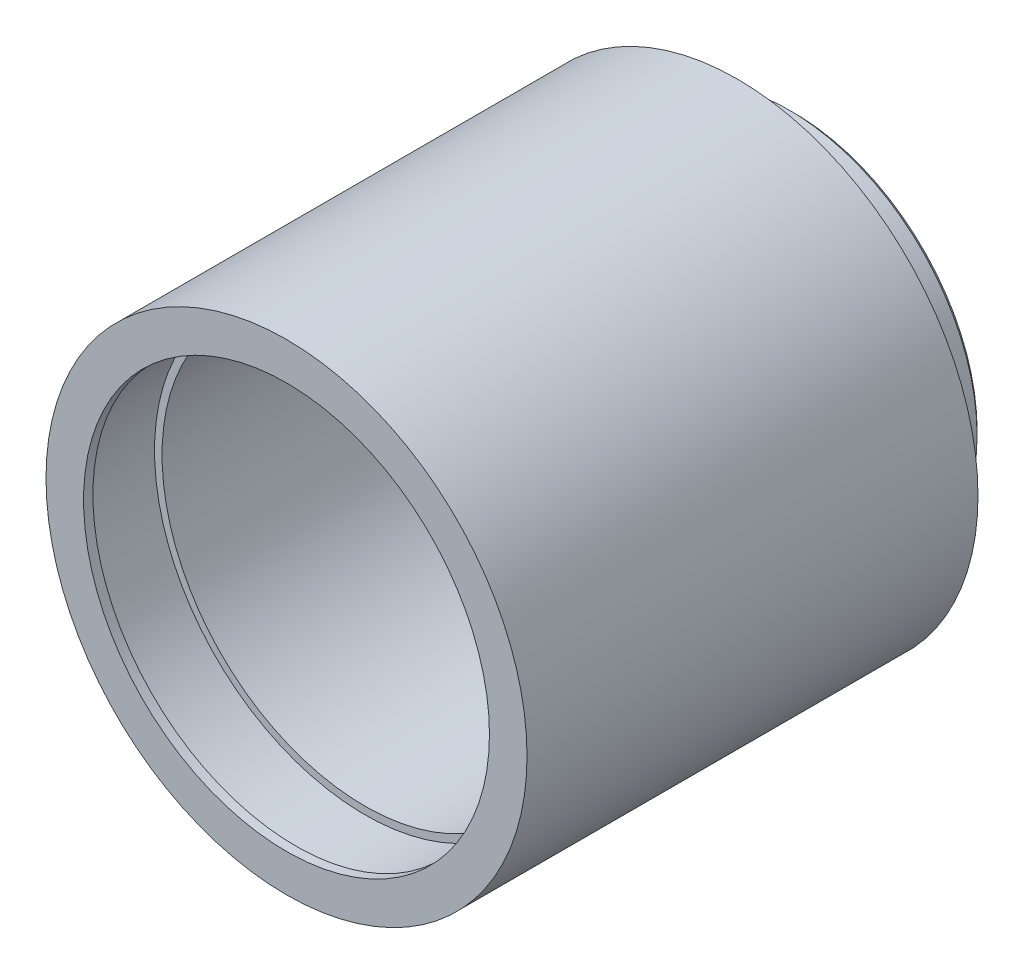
ISO-10303-21;
HEADER;
FILE_DESCRIPTION(('STEP AP214'),'2;1');
FILE_NAME('part.step','',(''),(''),'','','');
FILE_SCHEMA(('AUTOMOTIVE_DESIGN { 1 0 10303 214 1 1 1 1 }'));
ENDSEC;
DATA;
#1=APPLICATION_CONTEXT('core data for automotive mechanical design processes');
#2=APPLICATION_PROTOCOL_DEFINITION('international standard','automotive_design',2000,#1);
#3=PRODUCT_CONTEXT('',#1,'mechanical');
#4=PRODUCT('Part','Part','',(#3));
#5=PRODUCT_RELATED_PRODUCT_CATEGORY('part','',(#4));
#6=PRODUCT_DEFINITION_FORMATION('','',#4);
#7=PRODUCT_DEFINITION_CONTEXT('part definition',#1,'design');
#8=PRODUCT_DEFINITION('design','',#6,#7);
#9=PRODUCT_DEFINITION_SHAPE('','',#8);
#10=(LENGTH_UNIT() NAMED_UNIT(*) SI_UNIT(.MILLI.,.METRE.));
#11=(NAMED_UNIT(*) PLANE_ANGLE_UNIT() SI_UNIT($,.RADIAN.));
#12=(NAMED_UNIT(*) SI_UNIT($,.STERADIAN.) SOLID_ANGLE_UNIT());
#13=UNCERTAINTY_MEASURE_WITH_UNIT(LENGTH_MEASURE(1.E-05),#10,'distance_accuracy_value','');
#14=(GEOMETRIC_REPRESENTATION_CONTEXT(3) GLOBAL_UNCERTAINTY_ASSIGNED_CONTEXT((#13)) GLOBAL_UNIT_ASSIGNED_CONTEXT((#10,
#11,#12)) REPRESENTATION_CONTEXT('',''));
#15=CARTESIAN_POINT('',(0.,0.,0.));
#16=DIRECTION('',(0.,0.,1.));
#17=DIRECTION('',(1.,0.,0.));
#18=AXIS2_PLACEMENT_3D('',#15,#16,#17);
#19=CARTESIAN_POINT('',(0.,0.,0.));
#20=DIRECTION('',(0.,0.,0.999999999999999));
#21=DIRECTION('',(1.,0.,0.));
#22=AXIS2_PLACEMENT_3D('',#19,#20,#21);
#23=PLANE('',#22);
#24=CARTESIAN_POINT('',(0.,0.,0.));
#25=DIRECTION('',(0.,0.,0.999999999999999));
#26=DIRECTION('',(1.,0.,0.));
#27=AXIS2_PLACEMENT_3D('',#24,#25,#26);
#28=CIRCLE('',#27,20.32);
#29=CARTESIAN_POINT('',(-20.32,0.,0.));
#30=VERTEX_POINT('',#29);
#31=EDGE_CURVE('E37',#30,#30,#28,.T.);
#32=ORIENTED_EDGE('',*,*,#31,.F.);
#33=EDGE_LOOP('',(#32));
#34=FACE_BOUND('',#33,.T.);
#35=CARTESIAN_POINT('',(0.,0.,0.));
#36=DIRECTION('',(0.,0.,-0.999999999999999));
#37=DIRECTION('',(-1.,0.,0.));
#38=AXIS2_PLACEMENT_3D('',#35,#36,#37);
#39=CIRCLE('',#38,15.494);
#40=CARTESIAN_POINT('',(15.4940000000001,0.,0.));
#41=VERTEX_POINT('',#40);
#42=EDGE_CURVE('E45',#41,#41,#39,.T.);
#43=ORIENTED_EDGE('',*,*,#42,.F.);
#44=EDGE_LOOP('',(#43));
#45=FACE_BOUND('',#44,.T.);
#46=ADVANCED_FACE('F13',(#34,#45),#23,.F.);
#47=CARTESIAN_POINT('',(0.,0.,38.0999999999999));
#48=DIRECTION('',(0.,0.,-0.999999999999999));
#49=DIRECTION('',(-1.,0.,0.));
#50=AXIS2_PLACEMENT_3D('',#47,#48,#49);
#51=CYLINDRICAL_SURFACE('',#50,20.32);
#52=CARTESIAN_POINT('',(0.,0.,38.0999999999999));
#53=DIRECTION('',(0.,0.,0.999999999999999));
#54=DIRECTION('',(1.,0.,0.));
#55=AXIS2_PLACEMENT_3D('',#52,#53,#54);
#56=CIRCLE('',#55,20.32);
#57=CARTESIAN_POINT('',(-20.32,0.,38.0999999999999));
#58=VERTEX_POINT('',#57);
#59=EDGE_CURVE('E34',#58,#58,#56,.T.);
#60=CARTESIAN_POINT('',(-20.32,0.,38.0999999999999));
#61=CARTESIAN_POINT('',(-20.32,0.,37.7031249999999));
#62=CARTESIAN_POINT('',(-20.32,0.,37.3062499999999));
#63=CARTESIAN_POINT('',(-20.32,0.,36.5124999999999));
#64=CARTESIAN_POINT('',(-20.32,0.,36.1156249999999));
#65=CARTESIAN_POINT('',(-20.32,0.,35.3218749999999));
#66=CARTESIAN_POINT('',(-20.32,0.,34.9249999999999));
#67=CARTESIAN_POINT('',(-20.32,0.,34.1312499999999));
#68=CARTESIAN_POINT('',(-20.32,0.,33.7343749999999));
#69=CARTESIAN_POINT('',(-20.32,0.,32.9406249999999));
#70=CARTESIAN_POINT('',(-20.32,0.,32.5437499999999));
#71=CARTESIAN_POINT('',(-20.32,0.,31.75));
#72=CARTESIAN_POINT('',(-20.32,0.,31.3531249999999));
#73=CARTESIAN_POINT('',(-20.32,0.,30.5593749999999));
#74=CARTESIAN_POINT('',(-20.32,0.,30.1624999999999));
#75=CARTESIAN_POINT('',(-20.32,0.,29.3687499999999));
#76=CARTESIAN_POINT('',(-20.32,0.,28.971875));
#77=CARTESIAN_POINT('',(-20.32,0.,28.178125));
#78=CARTESIAN_POINT('',(-20.32,0.,27.78125));
#79=CARTESIAN_POINT('',(-20.32,0.,26.9875));
#80=CARTESIAN_POINT('',(-20.32,0.,26.590625));
#81=CARTESIAN_POINT('',(-20.32,0.,25.796875));
#82=CARTESIAN_POINT('',(-20.32,0.,25.4));
#83=CARTESIAN_POINT('',(-20.32,0.,24.60625));
#84=CARTESIAN_POINT('',(-20.32,0.,24.209375));
#85=CARTESIAN_POINT('',(-20.32,0.,23.415625));
#86=CARTESIAN_POINT('',(-20.32,0.,23.01875));
#87=CARTESIAN_POINT('',(-20.32,0.,22.225));
#88=CARTESIAN_POINT('',(-20.32,0.,21.828125));
#89=CARTESIAN_POINT('',(-20.32,0.,21.034375));
#90=CARTESIAN_POINT('',(-20.32,0.,20.6375));
#91=CARTESIAN_POINT('',(-20.32,0.,19.84375));
#92=CARTESIAN_POINT('',(-20.32,0.,19.446875));
#93=CARTESIAN_POINT('',(-20.32,0.,18.653125));
#94=CARTESIAN_POINT('',(-20.32,0.,18.25625));
#95=CARTESIAN_POINT('',(-20.32,0.,17.4625));
#96=CARTESIAN_POINT('',(-20.32,0.,17.065625));
#97=CARTESIAN_POINT('',(-20.32,0.,16.271875));
#98=CARTESIAN_POINT('',(-20.32,0.,15.875));
#99=CARTESIAN_POINT('',(-20.32,0.,15.08125));
#100=CARTESIAN_POINT('',(-20.32,0.,14.684375));
#101=CARTESIAN_POINT('',(-20.32,0.,13.890625));
#102=CARTESIAN_POINT('',(-20.32,0.,13.49375));
#103=CARTESIAN_POINT('',(-20.32,0.,12.7));
#104=CARTESIAN_POINT('',(-20.32,0.,12.303125));
#105=CARTESIAN_POINT('',(-20.32,0.,11.509375));
#106=CARTESIAN_POINT('',(-20.32,0.,11.1125));
#107=CARTESIAN_POINT('',(-20.32,0.,10.31875));
#108=CARTESIAN_POINT('',(-20.32,0.,9.92187499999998));
#109=CARTESIAN_POINT('',(-20.32,0.,9.12812499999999));
#110=CARTESIAN_POINT('',(-20.32,0.,8.73124999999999));
#111=CARTESIAN_POINT('',(-20.32,0.,7.93749999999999));
#112=CARTESIAN_POINT('',(-20.32,0.,7.54062499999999));
#113=CARTESIAN_POINT('',(-20.32,0.,6.74687499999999));
#114=CARTESIAN_POINT('',(-20.32,0.,6.34999999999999));
#115=CARTESIAN_POINT('',(-20.32,0.,5.55624999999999));
#116=CARTESIAN_POINT('',(-20.32,0.,5.15937499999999));
#117=CARTESIAN_POINT('',(-20.32,0.,4.36562499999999));
#118=CARTESIAN_POINT('',(-20.32,0.,3.96874999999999));
#119=CARTESIAN_POINT('',(-20.32,0.,3.175));
#120=CARTESIAN_POINT('',(-20.32,0.,2.778125));
#121=CARTESIAN_POINT('',(-20.32,0.,1.984375));
#122=CARTESIAN_POINT('',(-20.32,0.,1.5875));
#123=CARTESIAN_POINT('',(-20.32,0.,0.793750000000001));
#124=CARTESIAN_POINT('',(-20.32,0.,0.396875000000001));
#125=CARTESIAN_POINT('',(-20.32,0.,0.));
#126=B_SPLINE_CURVE_WITH_KNOTS('',3,(#60,#61,#62,#63,#64,#65,#66,#67,#68,#69,#70,#71,#72,#73,
#74,#75,#76,#77,#78,#79,#80,#81,#82,#83,#84,#85,#86,#87,#88,#89,#90,#91,#92,#93,#94,#95,#96,#97,
#98,#99,#100,#101,#102,#103,#104,#105,#106,#107,#108,#109,#110,#111,#112,#113,#114,#115,#116,
#117,#118,#119,#120,#121,#122,#123,#124,#125),.UNSPECIFIED.,.F.,.F.,(4,2,2,2,2,2,2,2,2,2,2,2,2,
2,2,2,2,2,2,2,2,2,2,2,2,2,2,2,2,2,2,2,4),(0.,1.19062499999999,2.38124999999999,3.57187499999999,
4.76249999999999,5.95312499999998,7.14374999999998,8.33437499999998,9.52499999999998,10.715625,
11.90625,13.096875,14.2875,15.478125,16.66875,17.859375,19.05,20.240625,21.43125,22.621875,
23.8125,25.003125,26.1937499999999,27.3843749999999,28.5749999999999,29.7656249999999,
30.9562499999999,32.1468749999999,33.3374999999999,34.5281249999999,35.7187499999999,
36.9093749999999,38.0999999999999),.UNSPECIFIED.);
#127=EDGE_CURVE('BSEAM114',#58,#30,#126,.T.);
#128=ORIENTED_EDGE('',*,*,#59,.F.);
#129=ORIENTED_EDGE('',*,*,#31,.T.);
#130=ORIENTED_EDGE('',*,*,#127,.T.);
#131=ORIENTED_EDGE('',*,*,#127,.F.);
#132=EDGE_LOOP('',(#128,#130,#129,#131));
#133=FACE_BOUND('',#132,.T.);
#134=ADVANCED_FACE('F114',(#133),#51,.T.);
#135=CARTESIAN_POINT('',(0.,0.,38.0999999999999));
#136=DIRECTION('',(0.,0.,0.999999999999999));
#137=DIRECTION('',(1.,0.,0.));
#138=AXIS2_PLACEMENT_3D('',#135,#136,#137);
#139=PLANE('',#138);
#140=CARTESIAN_POINT('',(0.,0.,38.0999999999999));
#141=DIRECTION('',(0.,0.,0.999999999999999));
#142=DIRECTION('',(1.,0.,0.));
#143=AXIS2_PLACEMENT_3D('',#140,#141,#142);
#144=CIRCLE('',#143,17.145);
#145=CARTESIAN_POINT('',(17.145,0.,38.0999999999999));
#146=VERTEX_POINT('',#145);
#147=EDGE_CURVE('E76',#146,#146,#144,.T.);
#148=ORIENTED_EDGE('',*,*,#147,.F.);
#149=EDGE_LOOP('',(#148));
#150=FACE_BOUND('',#149,.T.);
#151=ORIENTED_EDGE('',*,*,#59,.T.);
#152=EDGE_LOOP('',(#151));
#153=FACE_BOUND('',#152,.T.);
#154=ADVANCED_FACE('F120',(#150,#153),#139,.T.);
#155=CARTESIAN_POINT('',(0.,0.,-4.74979999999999));
#156=DIRECTION('',(0.,0.,0.999999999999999));
#157=DIRECTION('',(1.,0.,0.));
#158=AXIS2_PLACEMENT_3D('',#155,#156,#157);
#159=CYLINDRICAL_SURFACE('',#158,15.875);
#160=CARTESIAN_POINT('',(0.,0.,-4.3688));
#161=DIRECTION('',(0.,0.,-0.999999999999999));
#162=DIRECTION('',(-1.,0.,0.));
#163=AXIS2_PLACEMENT_3D('',#160,#161,#162);
#164=CIRCLE('',#163,15.875);
#165=CARTESIAN_POINT('',(15.875,0.,-4.3688));
#166=VERTEX_POINT('',#165);
#167=EDGE_CURVE('E9',#166,#166,#164,.F.);
#168=CARTESIAN_POINT('',(0.,0.,-1.143));
#169=DIRECTION('',(0.,0.,-0.999999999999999));
#170=DIRECTION('',(-1.,0.,0.));
#171=AXIS2_PLACEMENT_3D('',#168,#169,#170);
#172=CIRCLE('',#171,15.875);
#173=CARTESIAN_POINT('',(15.875,0.,-1.143));
#174=VERTEX_POINT('',#173);
#175=EDGE_CURVE('E21',#174,#174,#172,.T.);
#176=CARTESIAN_POINT('',(15.875,0.,-4.3688));
#177=CARTESIAN_POINT('',(15.875,0.,-4.33519791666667));
#178=CARTESIAN_POINT('',(15.875,0.,-4.30159583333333));
#179=CARTESIAN_POINT('',(15.875,0.,-4.23439166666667));
#180=CARTESIAN_POINT('',(15.875,0.,-4.20078958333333));
#181=CARTESIAN_POINT('',(15.875,0.,-4.13358541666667));
#182=CARTESIAN_POINT('',(15.875,0.,-4.09998333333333));
#183=CARTESIAN_POINT('',(15.875,0.,-4.03277916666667));
#184=CARTESIAN_POINT('',(15.875,0.,-3.99917708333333));
#185=CARTESIAN_POINT('',(15.875,0.,-3.93197291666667));
#186=CARTESIAN_POINT('',(15.875,0.,-3.89837083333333));
#187=CARTESIAN_POINT('',(15.875,0.,-3.83116666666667));
#188=CARTESIAN_POINT('',(15.875,0.,-3.79756458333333));
#189=CARTESIAN_POINT('',(15.875,0.,-3.73036041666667));
#190=CARTESIAN_POINT('',(15.875,0.,-3.69675833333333));
#191=CARTESIAN_POINT('',(15.875,0.,-3.62955416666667));
#192=CARTESIAN_POINT('',(15.875,0.,-3.59595208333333));
#193=CARTESIAN_POINT('',(15.875,0.,-3.52874791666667));
#194=CARTESIAN_POINT('',(15.875,0.,-3.49514583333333));
#195=CARTESIAN_POINT('',(15.875,0.,-3.42794166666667));
#196=CARTESIAN_POINT('',(15.875,0.,-3.39433958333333));
#197=CARTESIAN_POINT('',(15.875,0.,-3.32713541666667));
#198=CARTESIAN_POINT('',(15.875,0.,-3.29353333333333));
#199=CARTESIAN_POINT('',(15.875,0.,-3.22632916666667));
#200=CARTESIAN_POINT('',(15.875,0.,-3.19272708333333));
#201=CARTESIAN_POINT('',(15.875,0.,-3.12552291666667));
#202=CARTESIAN_POINT('',(15.875,0.,-3.09192083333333));
#203=CARTESIAN_POINT('',(15.875,0.,-3.02471666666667));
#204=CARTESIAN_POINT('',(15.875,0.,-2.99111458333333));
#205=CARTESIAN_POINT('',(15.875,0.,-2.92391041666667));
#206=CARTESIAN_POINT('',(15.875,0.,-2.89030833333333));
#207=CARTESIAN_POINT('',(15.875,0.,-2.82310416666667));
#208=CARTESIAN_POINT('',(15.875,0.,-2.78950208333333));
#209=CARTESIAN_POINT('',(15.875,0.,-2.72229791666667));
#210=CARTESIAN_POINT('',(15.875,0.,-2.68869583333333));
#211=CARTESIAN_POINT('',(15.875,0.,-2.62149166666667));
#212=CARTESIAN_POINT('',(15.875,0.,-2.58788958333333));
#213=CARTESIAN_POINT('',(15.875,0.,-2.52068541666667));
#214=CARTESIAN_POINT('',(15.875,0.,-2.48708333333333));
#215=CARTESIAN_POINT('',(15.875,0.,-2.41987916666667));
#216=CARTESIAN_POINT('',(15.875,0.,-2.38627708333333));
#217=CARTESIAN_POINT('',(15.875,0.,-2.31907291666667));
#218=CARTESIAN_POINT('',(15.875,0.,-2.28547083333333));
#219=CARTESIAN_POINT('',(15.875,0.,-2.21826666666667));
#220=CARTESIAN_POINT('',(15.875,0.,-2.18466458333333));
#221=CARTESIAN_POINT('',(15.875,0.,-2.11746041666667));
#222=CARTESIAN_POINT('',(15.875,0.,-2.08385833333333));
#223=CARTESIAN_POINT('',(15.875,0.,-2.01665416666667));
#224=CARTESIAN_POINT('',(15.875,0.,-1.98305208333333));
#225=CARTESIAN_POINT('',(15.875,0.,-1.91584791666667));
#226=CARTESIAN_POINT('',(15.875,0.,-1.88224583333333));
#227=CARTESIAN_POINT('',(15.875,0.,-1.81504166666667));
#228=CARTESIAN_POINT('',(15.875,0.,-1.78143958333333));
#229=CARTESIAN_POINT('',(15.875,0.,-1.71423541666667));
#230=CARTESIAN_POINT('',(15.875,0.,-1.68063333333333));
#231=CARTESIAN_POINT('',(15.875,0.,-1.61342916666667));
#232=CARTESIAN_POINT('',(15.875,0.,-1.57982708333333));
#233=CARTESIAN_POINT('',(15.875,0.,-1.51262291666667));
#234=CARTESIAN_POINT('',(15.875,0.,-1.47902083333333));
#235=CARTESIAN_POINT('',(15.875,0.,-1.41181666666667));
#236=CARTESIAN_POINT('',(15.875,0.,-1.37821458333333));
#237=CARTESIAN_POINT('',(15.875,0.,-1.31101041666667));
#238=CARTESIAN_POINT('',(15.875,0.,-1.27740833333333));
#239=CARTESIAN_POINT('',(15.875,0.,-1.21020416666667));
#240=CARTESIAN_POINT('',(15.875,0.,-1.17660208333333));
#241=CARTESIAN_POINT('',(15.875,0.,-1.143));
#242=B_SPLINE_CURVE_WITH_KNOTS('',3,(#176,#177,#178,#179,#180,#181,#182,#183,#184,#185,#186,
#187,#188,#189,#190,#191,#192,#193,#194,#195,#196,#197,#198,#199,#200,#201,#202,#203,#204,#205,
#206,#207,#208,#209,#210,#211,#212,#213,#214,#215,#216,#217,#218,#219,#220,#221,#222,#223,#224,
#225,#226,#227,#228,#229,#230,#231,#232,#233,#234,#235,#236,#237,#238,#239,#240,#241),
.UNSPECIFIED.,.F.,.F.,(4,2,2,2,2,2,2,2,2,2,2,2,2,2,2,2,2,2,2,2,2,2,2,2,2,2,2,2,2,2,2,2,4),(0.,
0.10080625,0.2016125,0.30241875,0.403225,0.50403125,0.6048375,0.70564375,0.80645,0.90725625,
1.0080625,1.10886875,1.209675,1.31048125,1.4112875,1.51209375,1.6129,1.71370625,1.8145125,
1.91531875,2.016125,2.11693125,2.2177375,2.31854375,2.41935,2.52015625,2.6209625,2.72176875,
2.822575,2.92338125,3.0241875,3.12499375,3.2258),.UNSPECIFIED.);
#243=EDGE_CURVE('BSEAM96',#166,#174,#242,.T.);
#244=ORIENTED_EDGE('',*,*,#167,.T.);
#245=ORIENTED_EDGE('',*,*,#175,.T.);
#246=ORIENTED_EDGE('',*,*,#243,.T.);
#247=ORIENTED_EDGE('',*,*,#243,.F.);
#248=EDGE_LOOP('',(#244,#246,#245,#247));
#249=FACE_BOUND('',#248,.T.);
#250=ADVANCED_FACE('F96',(#249),#159,.T.);
#251=CARTESIAN_POINT('',(0.,0.,-4.74979999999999));
#252=DIRECTION('',(0.,0.,-0.999999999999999));
#253=DIRECTION('',(-1.,0.,0.));
#254=AXIS2_PLACEMENT_3D('',#251,#252,#253);
#255=PLANE('',#254);
#256=CARTESIAN_POINT('',(0.,0.,-4.74979999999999));
#257=DIRECTION('',(0.,0.,-0.999999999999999));
#258=DIRECTION('',(-1.,0.,0.));
#259=AXIS2_PLACEMENT_3D('',#256,#257,#258);
#260=CIRCLE('',#259,12.7);
#261=CARTESIAN_POINT('',(-12.7,0.,-4.7498));
#262=VERTEX_POINT('',#261);
#263=EDGE_CURVE('E80',#262,#262,#260,.T.);
#264=ORIENTED_EDGE('',*,*,#263,.F.);
#265=EDGE_LOOP('',(#264));
#266=FACE_BOUND('',#265,.T.);
#267=CARTESIAN_POINT('',(0.,0.,-4.74979999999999));
#268=DIRECTION('',(0.,0.,-0.999999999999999));
#269=DIRECTION('',(-1.,0.,0.));
#270=AXIS2_PLACEMENT_3D('',#267,#268,#269);
#271=CIRCLE('',#270,15.494);
#272=CARTESIAN_POINT('',(15.494,0.,-4.74979999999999));
#273=VERTEX_POINT('',#272);
#274=EDGE_CURVE('E28',#273,#273,#271,.T.);
#275=ORIENTED_EDGE('',*,*,#274,.T.);
#276=EDGE_LOOP('',(#275));
#277=FACE_BOUND('',#276,.T.);
#278=ADVANCED_FACE('F92',(#266,#277),#255,.T.);
#279=CARTESIAN_POINT('',(0.,0.,-0.762000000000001));
#280=DIRECTION('',(0.,0.,0.999999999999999));
#281=DIRECTION('',(1.,0.,0.));
#282=AXIS2_PLACEMENT_3D('',#279,#280,#281);
#283=CYLINDRICAL_SURFACE('',#282,15.494);
#284=CARTESIAN_POINT('',(0.,0.,-0.762000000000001));
#285=DIRECTION('',(0.,0.,-0.999999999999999));
#286=DIRECTION('',(-1.,0.,0.));
#287=AXIS2_PLACEMENT_3D('',#284,#285,#286);
#288=CIRCLE('',#287,15.494);
#289=CARTESIAN_POINT('',(15.4940000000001,0.,-0.762000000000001));
#290=VERTEX_POINT('',#289);
#291=EDGE_CURVE('E41',#290,#290,#288,.T.);
#292=CARTESIAN_POINT('',(15.4940000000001,0.,-0.762000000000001));
#293=CARTESIAN_POINT('',(15.4940000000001,0.,-0.754062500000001));
#294=CARTESIAN_POINT('',(15.4940000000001,0.,-0.746125));
#295=CARTESIAN_POINT('',(15.4940000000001,0.,-0.73025));
#296=CARTESIAN_POINT('',(15.4940000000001,0.,-0.7223125));
#297=CARTESIAN_POINT('',(15.4940000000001,0.,-0.7064375));
#298=CARTESIAN_POINT('',(15.4940000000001,0.,-0.6985));
#299=CARTESIAN_POINT('',(15.4940000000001,0.,-0.682625));
#300=CARTESIAN_POINT('',(15.4940000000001,0.,-0.6746875));
#301=CARTESIAN_POINT('',(15.4940000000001,0.,-0.6588125));
#302=CARTESIAN_POINT('',(15.4940000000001,0.,-0.650875));
#303=CARTESIAN_POINT('',(15.4940000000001,0.,-0.635));
#304=CARTESIAN_POINT('',(15.4940000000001,0.,-0.6270625));
#305=CARTESIAN_POINT('',(15.4940000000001,0.,-0.6111875));
#306=CARTESIAN_POINT('',(15.4940000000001,0.,-0.60325));
#307=CARTESIAN_POINT('',(15.4940000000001,0.,-0.587375));
#308=CARTESIAN_POINT('',(15.4940000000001,0.,-0.5794375));
#309=CARTESIAN_POINT('',(15.4940000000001,0.,-0.5635625));
#310=CARTESIAN_POINT('',(15.4940000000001,0.,-0.555625));
#311=CARTESIAN_POINT('',(15.4940000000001,0.,-0.53975));
#312=CARTESIAN_POINT('',(15.4940000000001,0.,-0.5318125));
#313=CARTESIAN_POINT('',(15.4940000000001,0.,-0.5159375));
#314=CARTESIAN_POINT('',(15.4940000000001,0.,-0.508));
#315=CARTESIAN_POINT('',(15.4940000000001,0.,-0.492125));
#316=CARTESIAN_POINT('',(15.4940000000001,0.,-0.4841875));
#317=CARTESIAN_POINT('',(15.4940000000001,0.,-0.4683125));
#318=CARTESIAN_POINT('',(15.4940000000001,0.,-0.460375));
#319=CARTESIAN_POINT('',(15.4940000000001,0.,-0.4445));
#320=CARTESIAN_POINT('',(15.4940000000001,0.,-0.4365625));
#321=CARTESIAN_POINT('',(15.4940000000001,0.,-0.4206875));
#322=CARTESIAN_POINT('',(15.4940000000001,0.,-0.41275));
#323=CARTESIAN_POINT('',(15.4940000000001,0.,-0.396875));
#324=CARTESIAN_POINT('',(15.4940000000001,0.,-0.3889375));
#325=CARTESIAN_POINT('',(15.4940000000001,0.,-0.3730625));
#326=CARTESIAN_POINT('',(15.4940000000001,0.,-0.365125));
#327=CARTESIAN_POINT('',(15.4940000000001,0.,-0.34925));
#328=CARTESIAN_POINT('',(15.4940000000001,0.,-0.3413125));
#329=CARTESIAN_POINT('',(15.4940000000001,0.,-0.3254375));
#330=CARTESIAN_POINT('',(15.4940000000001,0.,-0.3175));
#331=CARTESIAN_POINT('',(15.4940000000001,0.,-0.301625));
#332=CARTESIAN_POINT('',(15.4940000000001,0.,-0.2936875));
#333=CARTESIAN_POINT('',(15.4940000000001,0.,-0.2778125));
#334=CARTESIAN_POINT('',(15.4940000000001,0.,-0.269875));
#335=CARTESIAN_POINT('',(15.4940000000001,0.,-0.254));
#336=CARTESIAN_POINT('',(15.4940000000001,0.,-0.2460625));
#337=CARTESIAN_POINT('',(15.4940000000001,0.,-0.2301875));
#338=CARTESIAN_POINT('',(15.4940000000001,0.,-0.22225));
#339=CARTESIAN_POINT('',(15.4940000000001,0.,-0.206375));
#340=CARTESIAN_POINT('',(15.4940000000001,0.,-0.1984375));
#341=CARTESIAN_POINT('',(15.4940000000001,0.,-0.1825625));
#342=CARTESIAN_POINT('',(15.4940000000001,0.,-0.174625));
#343=CARTESIAN_POINT('',(15.4940000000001,0.,-0.15875));
#344=CARTESIAN_POINT('',(15.4940000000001,0.,-0.1508125));
#345=CARTESIAN_POINT('',(15.4940000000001,0.,-0.1349375));
#346=CARTESIAN_POINT('',(15.4940000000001,0.,-0.127));
#347=CARTESIAN_POINT('',(15.4940000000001,0.,-0.111125));
#348=CARTESIAN_POINT('',(15.4940000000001,0.,-0.1031875));
#349=CARTESIAN_POINT('',(15.4940000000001,0.,-0.0873125));
#350=CARTESIAN_POINT('',(15.4940000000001,0.,-0.079375));
#351=CARTESIAN_POINT('',(15.4940000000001,0.,-0.0635));
#352=CARTESIAN_POINT('',(15.4940000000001,0.,-0.0555625));
#353=CARTESIAN_POINT('',(15.4940000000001,0.,-0.0396875));
#354=CARTESIAN_POINT('',(15.4940000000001,0.,-0.0317500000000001));
#355=CARTESIAN_POINT('',(15.4940000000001,0.,-0.015875));
#356=CARTESIAN_POINT('',(15.4940000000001,0.,-0.00793750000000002));
#357=CARTESIAN_POINT('',(15.4940000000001,0.,0.));
#358=B_SPLINE_CURVE_WITH_KNOTS('',3,(#292,#293,#294,#295,#296,#297,#298,#299,#300,#301,#302,
#303,#304,#305,#306,#307,#308,#309,#310,#311,#312,#313,#314,#315,#316,#317,#318,#319,#320,#321,
#322,#323,#324,#325,#326,#327,#328,#329,#330,#331,#332,#333,#334,#335,#336,#337,#338,#339,#340,
#341,#342,#343,#344,#345,#346,#347,#348,#349,#350,#351,#352,#353,#354,#355,#356,#357),
.UNSPECIFIED.,.F.,.F.,(4,2,2,2,2,2,2,2,2,2,2,2,2,2,2,2,2,2,2,2,2,2,2,2,2,2,2,2,2,2,2,2,4),(0.,
0.0238125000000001,0.0476250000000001,0.0714375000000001,0.0952500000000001,0.1190625,0.142875,
0.1666875,0.1905,0.2143125,0.238125,0.2619375,0.28575,0.3095625,0.333375,0.3571875,0.381,
0.4048125,0.428625,0.4524375,0.47625,0.5000625,0.523875,0.5476875,0.5715,0.5953125,0.619125,
0.6429375,0.666750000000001,0.690562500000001,0.714375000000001,0.7381875,0.762000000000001),.UNSPECIFIED.);
#359=EDGE_CURVE('BSEAM95',#290,#41,#358,.T.);
#360=ORIENTED_EDGE('',*,*,#291,.F.);
#361=ORIENTED_EDGE('',*,*,#42,.T.);
#362=ORIENTED_EDGE('',*,*,#359,.T.);
#363=ORIENTED_EDGE('',*,*,#359,.F.);
#364=EDGE_LOOP('',(#360,#362,#361,#363));
#365=FACE_BOUND('',#364,.T.);
#366=ADVANCED_FACE('F95',(#365),#283,.T.);
#367=CARTESIAN_POINT('',(0.,0.,-4.74979999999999));
#368=DIRECTION('',(0.,0.,0.999999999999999));
#369=DIRECTION('',(1.,0.,0.));
#370=AXIS2_PLACEMENT_3D('',#367,#368,#369);
#371=CONICAL_SURFACE('',#370,15.494,0.785398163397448);
#372=CARTESIAN_POINT('',(15.875,0.,-4.3688));
#373=CARTESIAN_POINT('',(15.87103125,0.,-4.37276875));
#374=CARTESIAN_POINT('',(15.8670625,0.,-4.3767375));
#375=CARTESIAN_POINT('',(15.859125,0.,-4.384675));
#376=CARTESIAN_POINT('',(15.85515625,0.,-4.38864375));
#377=CARTESIAN_POINT('',(15.84721875,0.,-4.39658125));
#378=CARTESIAN_POINT('',(15.84325,0.,-4.40055));
#379=CARTESIAN_POINT('',(15.8353125,0.,-4.4084875));
#380=CARTESIAN_POINT('',(15.83134375,0.,-4.41245625));
#381=CARTESIAN_POINT('',(15.82340625,0.,-4.42039375));
#382=CARTESIAN_POINT('',(15.8194375,0.,-4.4243625));
#383=CARTESIAN_POINT('',(15.8115,0.,-4.4323));
#384=CARTESIAN_POINT('',(15.80753125,0.,-4.43626875));
#385=CARTESIAN_POINT('',(15.79959375,0.,-4.44420625));
#386=CARTESIAN_POINT('',(15.795625,0.,-4.448175));
#387=CARTESIAN_POINT('',(15.7876875,0.,-4.4561125));
#388=CARTESIAN_POINT('',(15.78371875,0.,-4.46008125));
#389=CARTESIAN_POINT('',(15.77578125,0.,-4.46801875));
#390=CARTESIAN_POINT('',(15.7718125,0.,-4.4719875));
#391=CARTESIAN_POINT('',(15.763875,0.,-4.479925));
#392=CARTESIAN_POINT('',(15.75990625,0.,-4.48389375));
#393=CARTESIAN_POINT('',(15.75196875,0.,-4.49183125));
#394=CARTESIAN_POINT('',(15.748,0.,-4.4958));
#395=CARTESIAN_POINT('',(15.7400625,0.,-4.5037375));
#396=CARTESIAN_POINT('',(15.73609375,0.,-4.50770625));
#397=CARTESIAN_POINT('',(15.72815625,0.,-4.51564375));
#398=CARTESIAN_POINT('',(15.7241875,0.,-4.5196125));
#399=CARTESIAN_POINT('',(15.71625,0.,-4.52755));
#400=CARTESIAN_POINT('',(15.71228125,0.,-4.53151875));
#401=CARTESIAN_POINT('',(15.70434375,0.,-4.53945625));
#402=CARTESIAN_POINT('',(15.700375,0.,-4.543425));
#403=CARTESIAN_POINT('',(15.6924375,0.,-4.5513625));
#404=CARTESIAN_POINT('',(15.68846875,0.,-4.55533125));
#405=CARTESIAN_POINT('',(15.68053125,0.,-4.56326875));
#406=CARTESIAN_POINT('',(15.6765625,0.,-4.5672375));
#407=CARTESIAN_POINT('',(15.668625,0.,-4.575175));
#408=CARTESIAN_POINT('',(15.66465625,0.,-4.57914375));
#409=CARTESIAN_POINT('',(15.65671875,0.,-4.58708125));
#410=CARTESIAN_POINT('',(15.65275,0.,-4.59104999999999));
#411=CARTESIAN_POINT('',(15.6448125,0.,-4.5989875));
#412=CARTESIAN_POINT('',(15.64084375,0.,-4.60295624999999));
#413=CARTESIAN_POINT('',(15.63290625,0.,-4.61089375));
#414=CARTESIAN_POINT('',(15.6289375,0.,-4.6148625));
#415=CARTESIAN_POINT('',(15.621,0.,-4.62279999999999));
#416=CARTESIAN_POINT('',(15.61703125,0.,-4.62676874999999));
#417=CARTESIAN_POINT('',(15.60909375,0.,-4.63470624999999));
#418=CARTESIAN_POINT('',(15.605125,0.,-4.63867499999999));
#419=CARTESIAN_POINT('',(15.5971875,0.,-4.64661249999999));
#420=CARTESIAN_POINT('',(15.59321875,0.,-4.65058124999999));
#421=CARTESIAN_POINT('',(15.58528125,0.,-4.65851874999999));
#422=CARTESIAN_POINT('',(15.5813125,0.,-4.66248749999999));
#423=CARTESIAN_POINT('',(15.573375,0.,-4.67042499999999));
#424=CARTESIAN_POINT('',(15.56940625,0.,-4.67439374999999));
#425=CARTESIAN_POINT('',(15.56146875,0.,-4.68233124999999));
#426=CARTESIAN_POINT('',(15.5575,0.,-4.68629999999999));
#427=CARTESIAN_POINT('',(15.5495625,0.,-4.69423749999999));
#428=CARTESIAN_POINT('',(15.54559375,0.,-4.69820624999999));
#429=CARTESIAN_POINT('',(15.53765625,0.,-4.70614374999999));
#430=CARTESIAN_POINT('',(15.5336875,0.,-4.71011249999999));
#431=CARTESIAN_POINT('',(15.52575,0.,-4.71804999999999));
#432=CARTESIAN_POINT('',(15.52178125,0.,-4.72201874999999));
#433=CARTESIAN_POINT('',(15.51384375,0.,-4.72995624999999));
#434=CARTESIAN_POINT('',(15.509875,0.,-4.73392499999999));
#435=CARTESIAN_POINT('',(15.5019375,0.,-4.74186249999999));
#436=CARTESIAN_POINT('',(15.49796875,0.,-4.74583124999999));
#437=CARTESIAN_POINT('',(15.494,0.,-4.74979999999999));
#438=B_SPLINE_CURVE_WITH_KNOTS('',3,(#372,#373,#374,#375,#376,#377,#378,#379,#380,#381,#382,
#383,#384,#385,#386,#387,#388,#389,#390,#391,#392,#393,#394,#395,#396,#397,#398,#399,#400,#401,
#402,#403,#404,#405,#406,#407,#408,#409,#410,#411,#412,#413,#414,#415,#416,#417,#418,#419,#420,
#421,#422,#423,#424,#425,#426,#427,#428,#429,#430,#431,#432,#433,#434,#435,#436,#437),
.UNSPECIFIED.,.F.,.F.,(4,2,2,2,2,2,2,2,2,2,2,2,2,2,2,2,2,2,2,2,2,2,2,2,2,2,2,2,2,2,2,2,4),(0.,
0.0168379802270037,0.0336759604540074,0.0505139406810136,0.0673519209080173,0.084189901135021,
0.101027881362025,0.117865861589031,0.134703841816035,0.151541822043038,0.168379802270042,
0.185217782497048,0.202055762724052,0.218893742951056,0.235731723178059,0.252569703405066,
0.269407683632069,0.286245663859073,0.303083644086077,0.319921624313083,0.336759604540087,
0.35359758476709,0.370435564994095,0.387273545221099,0.404111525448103,0.420949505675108,
0.437787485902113,0.454625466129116,0.471463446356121,0.488301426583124,0.50513940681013,
0.521977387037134,0.538815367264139),.UNSPECIFIED.);
#439=EDGE_CURVE('BSEAM100',#166,#273,#438,.T.);
#440=ORIENTED_EDGE('',*,*,#167,.F.);
#441=ORIENTED_EDGE('',*,*,#274,.F.);
#442=ORIENTED_EDGE('',*,*,#439,.T.);
#443=ORIENTED_EDGE('',*,*,#439,.F.);
#444=EDGE_LOOP('',(#440,#442,#441,#443));
#445=FACE_BOUND('',#444,.T.);
#446=ADVANCED_FACE('F100',(#445),#371,.T.);
#447=CARTESIAN_POINT('',(0.,0.,-1.143));
#448=DIRECTION('',(0.,0.,-0.999999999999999));
#449=DIRECTION('',(-1.,0.,0.));
#450=AXIS2_PLACEMENT_3D('',#447,#448,#449);
#451=CONICAL_SURFACE('',#450,15.875,0.785398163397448);
#452=ORIENTED_EDGE('',*,*,#291,.T.);
#453=EDGE_LOOP('',(#452));
#454=FACE_BOUND('',#453,.T.);
#455=ORIENTED_EDGE('',*,*,#175,.F.);
#456=EDGE_LOOP('',(#455));
#457=FACE_BOUND('',#456,.T.);
#458=ADVANCED_FACE('F15',(#454,#457),#451,.T.);
#459=CARTESIAN_POINT('',(0.,0.,3.175));
#460=DIRECTION('',(0.,0.,0.999999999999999));
#461=DIRECTION('',(1.,0.,0.));
#462=AXIS2_PLACEMENT_3D('',#459,#460,#461);
#463=CYLINDRICAL_SURFACE('',#462,17.145);
#464=CARTESIAN_POINT('',(0.,0.,37.3125999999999));
#465=DIRECTION('',(0.,0.,0.999999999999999));
#466=DIRECTION('',(1.,0.,0.));
#467=AXIS2_PLACEMENT_3D('',#464,#465,#466);
#468=CIRCLE('',#467,17.145);
#469=CARTESIAN_POINT('',(17.145,0.,37.3125999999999));
#470=VERTEX_POINT('',#469);
#471=EDGE_CURVE('E49',#470,#470,#468,.F.);
#472=CARTESIAN_POINT('',(17.145,0.,37.3125999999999));
#473=CARTESIAN_POINT('',(17.145,0.,37.3208020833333));
#474=CARTESIAN_POINT('',(17.145,0.,37.3290041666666));
#475=CARTESIAN_POINT('',(17.145,0.,37.3454083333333));
#476=CARTESIAN_POINT('',(17.145,0.,37.3536104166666));
#477=CARTESIAN_POINT('',(17.145,0.,37.3700145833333));
#478=CARTESIAN_POINT('',(17.145,0.,37.3782166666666));
#479=CARTESIAN_POINT('',(17.145,0.,37.3946208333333));
#480=CARTESIAN_POINT('',(17.145,0.,37.4028229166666));
#481=CARTESIAN_POINT('',(17.145,0.,37.4192270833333));
#482=CARTESIAN_POINT('',(17.145,0.,37.4274291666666));
#483=CARTESIAN_POINT('',(17.145,0.,37.4438333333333));
#484=CARTESIAN_POINT('',(17.145,0.,37.4520354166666));
#485=CARTESIAN_POINT('',(17.145,0.,37.4684395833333));
#486=CARTESIAN_POINT('',(17.145,0.,37.4766416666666));
#487=CARTESIAN_POINT('',(17.145,0.,37.4930458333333));
#488=CARTESIAN_POINT('',(17.145,0.,37.5012479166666));
#489=CARTESIAN_POINT('',(17.145,0.,37.5176520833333));
#490=CARTESIAN_POINT('',(17.145,0.,37.5258541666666));
#491=CARTESIAN_POINT('',(17.145,0.,37.5422583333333));
#492=CARTESIAN_POINT('',(17.145,0.,37.5504604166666));
#493=CARTESIAN_POINT('',(17.145,0.,37.5668645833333));
#494=CARTESIAN_POINT('',(17.145,0.,37.5750666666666));
#495=CARTESIAN_POINT('',(17.145,0.,37.5914708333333));
#496=CARTESIAN_POINT('',(17.145,0.,37.5996729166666));
#497=CARTESIAN_POINT('',(17.145,0.,37.6160770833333));
#498=CARTESIAN_POINT('',(17.145,0.,37.6242791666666));
#499=CARTESIAN_POINT('',(17.145,0.,37.6406833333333));
#500=CARTESIAN_POINT('',(17.145,0.,37.6488854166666));
#501=CARTESIAN_POINT('',(17.145,0.,37.6652895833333));
#502=CARTESIAN_POINT('',(17.145,0.,37.6734916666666));
#503=CARTESIAN_POINT('',(17.145,0.,37.6898958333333));
#504=CARTESIAN_POINT('',(17.145,0.,37.6980979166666));
#505=CARTESIAN_POINT('',(17.145,0.,37.7145020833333));
#506=CARTESIAN_POINT('',(17.145,0.,37.7227041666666));
#507=CARTESIAN_POINT('',(17.145,0.,37.7391083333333));
#508=CARTESIAN_POINT('',(17.145,0.,37.7473104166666));
#509=CARTESIAN_POINT('',(17.145,0.,37.7637145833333));
#510=CARTESIAN_POINT('',(17.145,0.,37.7719166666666));
#511=CARTESIAN_POINT('',(17.145,0.,37.7883208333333));
#512=CARTESIAN_POINT('',(17.145,0.,37.7965229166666));
#513=CARTESIAN_POINT('',(17.145,0.,37.8129270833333));
#514=CARTESIAN_POINT('',(17.145,0.,37.8211291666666));
#515=CARTESIAN_POINT('',(17.145,0.,37.8375333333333));
#516=CARTESIAN_POINT('',(17.145,0.,37.8457354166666));
#517=CARTESIAN_POINT('',(17.145,0.,37.8621395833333));
#518=CARTESIAN_POINT('',(17.145,0.,37.8703416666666));
#519=CARTESIAN_POINT('',(17.145,0.,37.8867458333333));
#520=CARTESIAN_POINT('',(17.145,0.,37.8949479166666));
#521=CARTESIAN_POINT('',(17.145,0.,37.9113520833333));
#522=CARTESIAN_POINT('',(17.145,0.,37.9195541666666));
#523=CARTESIAN_POINT('',(17.145,0.,37.9359583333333));
#524=CARTESIAN_POINT('',(17.145,0.,37.9441604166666));
#525=CARTESIAN_POINT('',(17.145,0.,37.9605645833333));
#526=CARTESIAN_POINT('',(17.145,0.,37.9687666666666));
#527=CARTESIAN_POINT('',(17.145,0.,37.9851708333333));
#528=CARTESIAN_POINT('',(17.145,0.,37.9933729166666));
#529=CARTESIAN_POINT('',(17.145,0.,38.0097770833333));
#530=CARTESIAN_POINT('',(17.145,0.,38.0179791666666));
#531=CARTESIAN_POINT('',(17.145,0.,38.0343833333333));
#532=CARTESIAN_POINT('',(17.145,0.,38.0425854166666));
#533=CARTESIAN_POINT('',(17.145,0.,38.0589895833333));
#534=CARTESIAN_POINT('',(17.145,0.,38.0671916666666));
#535=CARTESIAN_POINT('',(17.145,0.,38.0835958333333));
#536=CARTESIAN_POINT('',(17.145,0.,38.0917979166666));
#537=CARTESIAN_POINT('',(17.145,0.,38.0999999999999));
#538=B_SPLINE_CURVE_WITH_KNOTS('',3,(#472,#473,#474,#475,#476,#477,#478,#479,#480,#481,#482,
#483,#484,#485,#486,#487,#488,#489,#490,#491,#492,#493,#494,#495,#496,#497,#498,#499,#500,#501,
#502,#503,#504,#505,#506,#507,#508,#509,#510,#511,#512,#513,#514,#515,#516,#517,#518,#519,#520,
#521,#522,#523,#524,#525,#526,#527,#528,#529,#530,#531,#532,#533,#534,#535,#536,#537),
.UNSPECIFIED.,.F.,.F.,(4,2,2,2,2,2,2,2,2,2,2,2,2,2,2,2,2,2,2,2,2,2,2,2,2,2,2,2,2,2,2,2,4),(0.,
0.0246062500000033,0.0492124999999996,0.0738187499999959,0.0984249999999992,0.123031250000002,
0.147637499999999,0.172243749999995,0.196849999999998,0.221456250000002,0.246062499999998,
0.270668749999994,0.295274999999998,0.319881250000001,0.344487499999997,0.369093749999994,
0.393699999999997,0.41830625,0.442912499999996,0.467518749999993,0.492124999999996,
0.516731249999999,0.541337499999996,0.565943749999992,0.590549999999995,0.615156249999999,
0.639762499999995,0.664368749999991,0.688974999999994,0.713581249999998,0.738187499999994,
0.76279374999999,0.787399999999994),.UNSPECIFIED.);
#539=EDGE_CURVE('BSEAM108',#470,#146,#538,.T.);
#540=ORIENTED_EDGE('',*,*,#471,.T.);
#541=ORIENTED_EDGE('',*,*,#147,.T.);
#542=ORIENTED_EDGE('',*,*,#539,.T.);
#543=ORIENTED_EDGE('',*,*,#539,.F.);
#544=EDGE_LOOP('',(#540,#542,#541,#543));
#545=FACE_BOUND('',#544,.T.);
#546=ADVANCED_FACE('F108',(#545),#463,.F.);
#547=CARTESIAN_POINT('',(0.,0.,37.3125999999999));
#548=DIRECTION('',(0.,0.,0.999999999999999));
#549=DIRECTION('',(1.,0.,0.));
#550=AXIS2_PLACEMENT_3D('',#547,#548,#549);
#551=PLANE('',#550);
#552=CARTESIAN_POINT('',(0.,0.,37.3125999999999));
#553=DIRECTION('',(0.,0.,0.999999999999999));
#554=DIRECTION('',(1.,0.,0.));
#555=AXIS2_PLACEMENT_3D('',#552,#553,#554);
#556=CIRCLE('',#555,17.78);
#557=CARTESIAN_POINT('',(17.78,0.,37.3125999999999));
#558=VERTEX_POINT('',#557);
#559=EDGE_CURVE('E56',#558,#558,#556,.T.);
#560=ORIENTED_EDGE('',*,*,#559,.F.);
#561=EDGE_LOOP('',(#560));
#562=FACE_BOUND('',#561,.T.);
#563=ORIENTED_EDGE('',*,*,#471,.F.);
#564=EDGE_LOOP('',(#563));
#565=FACE_BOUND('',#564,.T.);
#566=ADVANCED_FACE('F130',(#562,#565),#551,.F.);
#567=CARTESIAN_POINT('',(0.,0.,31.4705999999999));
#568=DIRECTION('',(0.,0.,0.999999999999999));
#569=DIRECTION('',(1.,0.,0.));
#570=AXIS2_PLACEMENT_3D('',#567,#568,#569);
#571=CYLINDRICAL_SURFACE('',#570,17.78);
#572=CARTESIAN_POINT('',(0.,0.,31.4705999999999));
#573=DIRECTION('',(0.,0.,0.999999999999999));
#574=DIRECTION('',(1.,0.,0.));
#575=AXIS2_PLACEMENT_3D('',#572,#573,#574);
#576=CIRCLE('',#575,17.78);
#577=CARTESIAN_POINT('',(17.78,0.,31.4705999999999));
#578=VERTEX_POINT('',#577);
#579=EDGE_CURVE('E60',#578,#578,#576,.T.);
#580=CARTESIAN_POINT('',(17.78,0.,31.4705999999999));
#581=CARTESIAN_POINT('',(17.78,0.,31.5314541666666));
#582=CARTESIAN_POINT('',(17.78,0.,31.5923083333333));
#583=CARTESIAN_POINT('',(17.78,0.,31.7140166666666));
#584=CARTESIAN_POINT('',(17.78,0.,31.7748708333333));
#585=CARTESIAN_POINT('',(17.78,0.,31.8965791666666));
#586=CARTESIAN_POINT('',(17.78,0.,31.9574333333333));
#587=CARTESIAN_POINT('',(17.78,0.,32.0791416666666));
#588=CARTESIAN_POINT('',(17.78,0.,32.1399958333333));
#589=CARTESIAN_POINT('',(17.78,0.,32.2617041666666));
#590=CARTESIAN_POINT('',(17.78,0.,32.3225583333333));
#591=CARTESIAN_POINT('',(17.78,0.,32.4442666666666));
#592=CARTESIAN_POINT('',(17.78,0.,32.5051208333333));
#593=CARTESIAN_POINT('',(17.78,0.,32.6268291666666));
#594=CARTESIAN_POINT('',(17.78,0.,32.6876833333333));
#595=CARTESIAN_POINT('',(17.78,0.,32.8093916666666));
#596=CARTESIAN_POINT('',(17.78,0.,32.8702458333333));
#597=CARTESIAN_POINT('',(17.78,0.,32.9919541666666));
#598=CARTESIAN_POINT('',(17.78,0.,33.0528083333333));
#599=CARTESIAN_POINT('',(17.78,0.,33.1745166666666));
#600=CARTESIAN_POINT('',(17.78,0.,33.2353708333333));
#601=CARTESIAN_POINT('',(17.78,0.,33.3570791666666));
#602=CARTESIAN_POINT('',(17.78,0.,33.4179333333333));
#603=CARTESIAN_POINT('',(17.78,0.,33.5396416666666));
#604=CARTESIAN_POINT('',(17.78,0.,33.6004958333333));
#605=CARTESIAN_POINT('',(17.78,0.,33.7222041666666));
#606=CARTESIAN_POINT('',(17.78,0.,33.7830583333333));
#607=CARTESIAN_POINT('',(17.78,0.,33.9047666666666));
#608=CARTESIAN_POINT('',(17.78,0.,33.9656208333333));
#609=CARTESIAN_POINT('',(17.78,0.,34.0873291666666));
#610=CARTESIAN_POINT('',(17.78,0.,34.1481833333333));
#611=CARTESIAN_POINT('',(17.78,0.,34.2698916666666));
#612=CARTESIAN_POINT('',(17.78,0.,34.3307458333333));
#613=CARTESIAN_POINT('',(17.78,0.,34.4524541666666));
#614=CARTESIAN_POINT('',(17.78,0.,34.5133083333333));
#615=CARTESIAN_POINT('',(17.78,0.,34.6350166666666));
#616=CARTESIAN_POINT('',(17.78,0.,34.6958708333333));
#617=CARTESIAN_POINT('',(17.78,0.,34.8175791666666));
#618=CARTESIAN_POINT('',(17.78,0.,34.8784333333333));
#619=CARTESIAN_POINT('',(17.78,0.,35.0001416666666));
#620=CARTESIAN_POINT('',(17.78,0.,35.0609958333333));
#621=CARTESIAN_POINT('',(17.78,0.,35.1827041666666));
#622=CARTESIAN_POINT('',(17.78,0.,35.2435583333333));
#623=CARTESIAN_POINT('',(17.78,0.,35.3652666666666));
#624=CARTESIAN_POINT('',(17.78,0.,35.4261208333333));
#625=CARTESIAN_POINT('',(17.78,0.,35.5478291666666));
#626=CARTESIAN_POINT('',(17.78,0.,35.6086833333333));
#627=CARTESIAN_POINT('',(17.78,0.,35.7303916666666));
#628=CARTESIAN_POINT('',(17.78,0.,35.7912458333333));
#629=CARTESIAN_POINT('',(17.78,0.,35.9129541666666));
#630=CARTESIAN_POINT('',(17.78,0.,35.9738083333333));
#631=CARTESIAN_POINT('',(17.78,0.,36.0955166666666));
#632=CARTESIAN_POINT('',(17.78,0.,36.1563708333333));
#633=CARTESIAN_POINT('',(17.78,0.,36.2780791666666));
#634=CARTESIAN_POINT('',(17.78,0.,36.3389333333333));
#635=CARTESIAN_POINT('',(17.78,0.,36.4606416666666));
#636=CARTESIAN_POINT('',(17.78,0.,36.5214958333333));
#637=CARTESIAN_POINT('',(17.78,0.,36.6432041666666));
#638=CARTESIAN_POINT('',(17.78,0.,36.7040583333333));
#639=CARTESIAN_POINT('',(17.78,0.,36.8257666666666));
#640=CARTESIAN_POINT('',(17.78,0.,36.8866208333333));
#641=CARTESIAN_POINT('',(17.78,0.,37.0083291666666));
#642=CARTESIAN_POINT('',(17.78,0.,37.0691833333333));
#643=CARTESIAN_POINT('',(17.78,0.,37.1908916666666));
#644=CARTESIAN_POINT('',(17.78,0.,37.2517458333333));
#645=CARTESIAN_POINT('',(17.78,0.,37.3125999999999));
#646=B_SPLINE_CURVE_WITH_KNOTS('',3,(#580,#581,#582,#583,#584,#585,#586,#587,#588,#589,#590,
#591,#592,#593,#594,#595,#596,#597,#598,#599,#600,#601,#602,#603,#604,#605,#606,#607,#608,#609,
#610,#611,#612,#613,#614,#615,#616,#617,#618,#619,#620,#621,#622,#623,#624,#625,#626,#627,#628,
#629,#630,#631,#632,#633,#634,#635,#636,#637,#638,#639,#640,#641,#642,#643,#644,#645),
.UNSPECIFIED.,.F.,.F.,(4,2,2,2,2,2,2,2,2,2,2,2,2,2,2,2,2,2,2,2,2,2,2,2,2,2,2,2,2,2,2,2,4),(0.,
0.182562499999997,0.365124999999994,0.547687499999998,0.730249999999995,0.912812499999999,
1.095375,1.2779375,1.4605,1.64306249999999,1.825625,2.00818749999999,2.19075,2.3733125,2.555875,
2.7384375,2.92099999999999,3.1035625,3.28612499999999,3.4686875,3.65124999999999,3.8338125,
4.016375,4.1989375,4.3815,4.56406249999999,4.746625,4.92918749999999,5.11175,5.29431249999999,
5.476875,5.6594375,5.84199999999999),.UNSPECIFIED.);
#647=EDGE_CURVE('BSEAM133',#578,#558,#646,.T.);
#648=ORIENTED_EDGE('',*,*,#579,.F.);
#649=ORIENTED_EDGE('',*,*,#559,.T.);
#650=ORIENTED_EDGE('',*,*,#647,.T.);
#651=ORIENTED_EDGE('',*,*,#647,.F.);
#652=EDGE_LOOP('',(#648,#650,#649,#651));
#653=FACE_BOUND('',#652,.T.);
#654=ADVANCED_FACE('F133',(#653),#571,.F.);
#655=CARTESIAN_POINT('',(0.,0.,31.4705999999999));
#656=DIRECTION('',(0.,0.,0.999999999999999));
#657=DIRECTION('',(1.,0.,0.));
#658=AXIS2_PLACEMENT_3D('',#655,#656,#657);
#659=PLANE('',#658);
#660=ORIENTED_EDGE('',*,*,#579,.T.);
#661=EDGE_LOOP('',(#660));
#662=FACE_BOUND('',#661,.T.);
#663=CARTESIAN_POINT('',(0.,0.,31.4705999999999));
#664=DIRECTION('',(0.,0.,0.999999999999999));
#665=DIRECTION('',(1.,0.,0.));
#666=AXIS2_PLACEMENT_3D('',#663,#664,#665);
#667=CIRCLE('',#666,17.145);
#668=CARTESIAN_POINT('',(17.145,0.,31.4705999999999));
#669=VERTEX_POINT('',#668);
#670=EDGE_CURVE('E68',#669,#669,#667,.F.);
#671=ORIENTED_EDGE('',*,*,#670,.T.);
#672=EDGE_LOOP('',(#671));
#673=FACE_BOUND('',#672,.T.);
#674=ADVANCED_FACE('F137',(#662,#673),#659,.T.);
#675=CARTESIAN_POINT('',(0.,0.,38.0999999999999));
#676=DIRECTION('',(0.,0.,-0.999999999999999));
#677=DIRECTION('',(-1.,0.,0.));
#678=AXIS2_PLACEMENT_3D('',#675,#676,#677);
#679=CYLINDRICAL_SURFACE('',#678,12.7);
#680=CARTESIAN_POINT('',(0.,0.,3.175));
#681=DIRECTION('',(0.,0.,0.999999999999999));
#682=DIRECTION('',(1.,0.,0.));
#683=AXIS2_PLACEMENT_3D('',#680,#681,#682);
#684=CIRCLE('',#683,12.7);
#685=CARTESIAN_POINT('',(-12.7,0.,3.175));
#686=VERTEX_POINT('',#685);
#687=EDGE_CURVE('E64',#686,#686,#684,.F.);
#688=CARTESIAN_POINT('',(-12.7,0.,-4.7498));
#689=CARTESIAN_POINT('',(-12.7,0.,-4.66725));
#690=CARTESIAN_POINT('',(-12.7,0.,-4.5847));
#691=CARTESIAN_POINT('',(-12.7,0.,-4.4196));
#692=CARTESIAN_POINT('',(-12.7,0.,-4.33705));
#693=CARTESIAN_POINT('',(-12.7,0.,-4.17195));
#694=CARTESIAN_POINT('',(-12.7,0.,-4.0894));
#695=CARTESIAN_POINT('',(-12.7,0.,-3.9243));
#696=CARTESIAN_POINT('',(-12.7,0.,-3.84175));
#697=CARTESIAN_POINT('',(-12.7,0.,-3.67665));
#698=CARTESIAN_POINT('',(-12.7,0.,-3.5941));
#699=CARTESIAN_POINT('',(-12.7,0.,-3.429));
#700=CARTESIAN_POINT('',(-12.7,0.,-3.34645));
#701=CARTESIAN_POINT('',(-12.7,0.,-3.18135));
#702=CARTESIAN_POINT('',(-12.7,0.,-3.0988));
#703=CARTESIAN_POINT('',(-12.7,0.,-2.9337));
#704=CARTESIAN_POINT('',(-12.7,0.,-2.85115));
#705=CARTESIAN_POINT('',(-12.7,0.,-2.68605));
#706=CARTESIAN_POINT('',(-12.7,0.,-2.60349999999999));
#707=CARTESIAN_POINT('',(-12.7,0.,-2.43839999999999));
#708=CARTESIAN_POINT('',(-12.7,0.,-2.35584999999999));
#709=CARTESIAN_POINT('',(-12.7,0.,-2.19074999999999));
#710=CARTESIAN_POINT('',(-12.7,0.,-2.1082));
#711=CARTESIAN_POINT('',(-12.7,0.,-1.9431));
#712=CARTESIAN_POINT('',(-12.7,0.,-1.86055));
#713=CARTESIAN_POINT('',(-12.7,0.,-1.69544999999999));
#714=CARTESIAN_POINT('',(-12.7,0.,-1.61289999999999));
#715=CARTESIAN_POINT('',(-12.7,0.,-1.44779999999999));
#716=CARTESIAN_POINT('',(-12.7,0.,-1.36525));
#717=CARTESIAN_POINT('',(-12.7,0.,-1.20015));
#718=CARTESIAN_POINT('',(-12.7,0.,-1.1176));
#719=CARTESIAN_POINT('',(-12.7,0.,-0.952499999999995));
#720=CARTESIAN_POINT('',(-12.7,0.,-0.869949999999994));
#721=CARTESIAN_POINT('',(-12.7,0.,-0.704849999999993));
#722=CARTESIAN_POINT('',(-12.7,0.,-0.622299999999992));
#723=CARTESIAN_POINT('',(-12.7,0.,-0.457199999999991));
#724=CARTESIAN_POINT('',(-12.7,0.,-0.37464999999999));
#725=CARTESIAN_POINT('',(-12.7,0.,-0.209549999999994));
#726=CARTESIAN_POINT('',(-12.7,0.,-0.126999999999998));
#727=CARTESIAN_POINT('',(-12.7,0.,0.0380999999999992));
#728=CARTESIAN_POINT('',(-12.7,0.,0.12065));
#729=CARTESIAN_POINT('',(-12.7,0.,0.285750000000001));
#730=CARTESIAN_POINT('',(-12.7,0.,0.368300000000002));
#731=CARTESIAN_POINT('',(-12.7,0.,0.533400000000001));
#732=CARTESIAN_POINT('',(-12.7,0.,0.615949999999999));
#733=CARTESIAN_POINT('',(-12.7,0.,0.781049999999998));
#734=CARTESIAN_POINT('',(-12.7,0.,0.863599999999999));
#735=CARTESIAN_POINT('',(-12.7,0.,1.0287));
#736=CARTESIAN_POINT('',(-12.7,0.,1.11125));
#737=CARTESIAN_POINT('',(-12.7,0.,1.27635));
#738=CARTESIAN_POINT('',(-12.7,0.,1.3589));
#739=CARTESIAN_POINT('',(-12.7,0.,1.524));
#740=CARTESIAN_POINT('',(-12.7,0.,1.60655000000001));
#741=CARTESIAN_POINT('',(-12.7,0.,1.77165));
#742=CARTESIAN_POINT('',(-12.7,0.,1.8542));
#743=CARTESIAN_POINT('',(-12.7,0.,2.0193));
#744=CARTESIAN_POINT('',(-12.7,0.,2.10185));
#745=CARTESIAN_POINT('',(-12.7,0.,2.26695));
#746=CARTESIAN_POINT('',(-12.7,0.,2.3495));
#747=CARTESIAN_POINT('',(-12.7,0.,2.5146));
#748=CARTESIAN_POINT('',(-12.7,0.,2.59715));
#749=CARTESIAN_POINT('',(-12.7,0.,2.76225));
#750=CARTESIAN_POINT('',(-12.7,0.,2.8448));
#751=CARTESIAN_POINT('',(-12.7,0.,3.0099));
#752=CARTESIAN_POINT('',(-12.7,0.,3.09245));
#753=CARTESIAN_POINT('',(-12.7,0.,3.175));
#754=B_SPLINE_CURVE_WITH_KNOTS('',3,(#688,#689,#690,#691,#692,#693,#694,#695,#696,#697,#698,
#699,#700,#701,#702,#703,#704,#705,#706,#707,#708,#709,#710,#711,#712,#713,#714,#715,#716,#717,
#718,#719,#720,#721,#722,#723,#724,#725,#726,#727,#728,#729,#730,#731,#732,#733,#734,#735,#736,
#737,#738,#739,#740,#741,#742,#743,#744,#745,#746,#747,#748,#749,#750,#751,#752,#753),
.UNSPECIFIED.,.F.,.F.,(4,2,2,2,2,2,2,2,2,2,2,2,2,2,2,2,2,2,2,2,2,2,2,2,2,2,2,2,2,2,2,2,4),(0.,
0.247650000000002,0.495300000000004,0.742949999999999,0.990600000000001,1.23825,1.4859,1.73355,
1.9812,2.22885,2.47650000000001,2.72415,2.9718,3.21945000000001,3.4671,3.71475,3.96240000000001,
4.21005000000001,4.45770000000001,4.70535,4.953,5.20065,5.4483,5.69595,5.9436,6.19125,6.4389,
6.68655,6.9342,7.18185,7.4295,7.67715,7.9248),.UNSPECIFIED.);
#755=EDGE_CURVE('BSEAM89',#262,#686,#754,.T.);
#756=ORIENTED_EDGE('',*,*,#263,.T.);
#757=ORIENTED_EDGE('',*,*,#687,.F.);
#758=ORIENTED_EDGE('',*,*,#755,.T.);
#759=ORIENTED_EDGE('',*,*,#755,.F.);
#760=EDGE_LOOP('',(#756,#758,#757,#759));
#761=FACE_BOUND('',#760,.T.);
#762=ADVANCED_FACE('F89',(#761),#679,.F.);
#763=CARTESIAN_POINT('',(0.,0.,3.175));
#764=DIRECTION('',(0.,0.,0.999999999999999));
#765=DIRECTION('',(1.,0.,0.));
#766=AXIS2_PLACEMENT_3D('',#763,#764,#765);
#767=PLANE('',#766);
#768=CARTESIAN_POINT('',(0.,0.,3.175));
#769=DIRECTION('',(0.,0.,0.999999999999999));
#770=DIRECTION('',(1.,0.,0.));
#771=AXIS2_PLACEMENT_3D('',#768,#769,#770);
#772=CIRCLE('',#771,17.145);
#773=CARTESIAN_POINT('',(17.145,0.,3.175));
#774=VERTEX_POINT('',#773);
#775=EDGE_CURVE('E72',#774,#774,#772,.T.);
#776=ORIENTED_EDGE('',*,*,#775,.T.);
#777=EDGE_LOOP('',(#776));
#778=FACE_BOUND('',#777,.T.);
#779=ORIENTED_EDGE('',*,*,#687,.T.);
#780=EDGE_LOOP('',(#779));
#781=FACE_BOUND('',#780,.T.);
#782=ADVANCED_FACE('F144',(#778,#781),#767,.T.);
#783=CARTESIAN_POINT('',(17.145,0.,3.175));
#784=CARTESIAN_POINT('',(17.145,0.,3.46974583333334));
#785=CARTESIAN_POINT('',(17.145,0.,3.76449166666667));
#786=CARTESIAN_POINT('',(17.145,0.,4.35398333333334));
#787=CARTESIAN_POINT('',(17.145,0.,4.64872916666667));
#788=CARTESIAN_POINT('',(17.145,0.,5.23822083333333));
#789=CARTESIAN_POINT('',(17.145,0.,5.53296666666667));
#790=CARTESIAN_POINT('',(17.145,0.,6.12245833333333));
#791=CARTESIAN_POINT('',(17.145,0.,6.41720416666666));
#792=CARTESIAN_POINT('',(17.145,0.,7.00669583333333));
#793=CARTESIAN_POINT('',(17.145,0.,7.30144166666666));
#794=CARTESIAN_POINT('',(17.145,0.,7.89093333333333));
#795=CARTESIAN_POINT('',(17.145,0.,8.18567916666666));
#796=CARTESIAN_POINT('',(17.145,0.,8.77517083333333));
#797=CARTESIAN_POINT('',(17.145,0.,9.06991666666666));
#798=CARTESIAN_POINT('',(17.145,0.,9.65940833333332));
#799=CARTESIAN_POINT('',(17.145,0.,9.95415416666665));
#800=CARTESIAN_POINT('',(17.145,0.,10.5436458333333));
#801=CARTESIAN_POINT('',(17.145,0.,10.8383916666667));
#802=CARTESIAN_POINT('',(17.145,0.,11.4278833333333));
#803=CARTESIAN_POINT('',(17.145,0.,11.7226291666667));
#804=CARTESIAN_POINT('',(17.145,0.,12.3121208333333));
#805=CARTESIAN_POINT('',(17.145,0.,12.6068666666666));
#806=CARTESIAN_POINT('',(17.145,0.,13.1963583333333));
#807=CARTESIAN_POINT('',(17.145,0.,13.4911041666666));
#808=CARTESIAN_POINT('',(17.145,0.,14.0805958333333));
#809=CARTESIAN_POINT('',(17.145,0.,14.3753416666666));
#810=CARTESIAN_POINT('',(17.145,0.,14.9648333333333));
#811=CARTESIAN_POINT('',(17.145,0.,15.2595791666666));
#812=CARTESIAN_POINT('',(17.145,0.,15.8490708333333));
#813=CARTESIAN_POINT('',(17.145,0.,16.1438166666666));
#814=CARTESIAN_POINT('',(17.145,0.,16.7333083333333));
#815=CARTESIAN_POINT('',(17.145,0.,17.0280541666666));
#816=CARTESIAN_POINT('',(17.145,0.,17.6175458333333));
#817=CARTESIAN_POINT('',(17.145,0.,17.9122916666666));
#818=CARTESIAN_POINT('',(17.145,0.,18.5017833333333));
#819=CARTESIAN_POINT('',(17.145,0.,18.7965291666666));
#820=CARTESIAN_POINT('',(17.145,0.,19.3860208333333));
#821=CARTESIAN_POINT('',(17.145,0.,19.6807666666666));
#822=CARTESIAN_POINT('',(17.145,0.,20.2702583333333));
#823=CARTESIAN_POINT('',(17.145,0.,20.5650041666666));
#824=CARTESIAN_POINT('',(17.145,0.,21.1544958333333));
#825=CARTESIAN_POINT('',(17.145,0.,21.4492416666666));
#826=CARTESIAN_POINT('',(17.145,0.,22.0387333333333));
#827=CARTESIAN_POINT('',(17.145,0.,22.3334791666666));
#828=CARTESIAN_POINT('',(17.145,0.,22.9229708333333));
#829=CARTESIAN_POINT('',(17.145,0.,23.2177166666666));
#830=CARTESIAN_POINT('',(17.145,0.,23.8072083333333));
#831=CARTESIAN_POINT('',(17.145,0.,24.1019541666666));
#832=CARTESIAN_POINT('',(17.145,0.,24.6914458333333));
#833=CARTESIAN_POINT('',(17.145,0.,24.9861916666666));
#834=CARTESIAN_POINT('',(17.145,0.,25.5756833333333));
#835=CARTESIAN_POINT('',(17.145,0.,25.8704291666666));
#836=CARTESIAN_POINT('',(17.145,0.,26.4599208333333));
#837=CARTESIAN_POINT('',(17.145,0.,26.7546666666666));
#838=CARTESIAN_POINT('',(17.145,0.,27.3441583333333));
#839=CARTESIAN_POINT('',(17.145,0.,27.6389041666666));
#840=CARTESIAN_POINT('',(17.145,0.,28.2283958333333));
#841=CARTESIAN_POINT('',(17.145,0.,28.5231416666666));
#842=CARTESIAN_POINT('',(17.145,0.,29.1126333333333));
#843=CARTESIAN_POINT('',(17.145,0.,29.4073791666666));
#844=CARTESIAN_POINT('',(17.145,0.,29.9968708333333));
#845=CARTESIAN_POINT('',(17.145,0.,30.2916166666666));
#846=CARTESIAN_POINT('',(17.145,0.,30.8811083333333));
#847=CARTESIAN_POINT('',(17.145,0.,31.1758541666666));
#848=CARTESIAN_POINT('',(17.145,0.,31.4705999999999));
#849=B_SPLINE_CURVE_WITH_KNOTS('',3,(#783,#784,#785,#786,#787,#788,#789,#790,#791,#792,#793,
#794,#795,#796,#797,#798,#799,#800,#801,#802,#803,#804,#805,#806,#807,#808,#809,#810,#811,#812,
#813,#814,#815,#816,#817,#818,#819,#820,#821,#822,#823,#824,#825,#826,#827,#828,#829,#830,#831,
#832,#833,#834,#835,#836,#837,#838,#839,#840,#841,#842,#843,#844,#845,#846,#847,#848),
.UNSPECIFIED.,.F.,.F.,(4,2,2,2,2,2,2,2,2,2,2,2,2,2,2,2,2,2,2,2,2,2,2,2,2,2,2,2,2,2,2,2,4),(0.,
0.884237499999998,1.768475,2.65271249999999,3.53694999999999,4.42118749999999,5.30542499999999,
6.18966249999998,7.07389999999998,7.95813749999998,8.84237499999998,9.72661249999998,10.61085,
11.4950875,12.379325,13.2635625,14.1478,15.0320375,15.916275,16.8005125,17.68475,18.5689875,
19.453225,20.3374624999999,21.2216999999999,22.1059374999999,22.9901749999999,23.8744124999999,
24.7586499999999,25.6428874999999,26.5271249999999,27.4113624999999,28.2955999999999),.UNSPECIFIED.);
#850=EDGE_CURVE('BSEAM147',#774,#669,#849,.T.);
#851=ORIENTED_EDGE('',*,*,#775,.F.);
#852=ORIENTED_EDGE('',*,*,#670,.F.);
#853=ORIENTED_EDGE('',*,*,#850,.T.);
#854=ORIENTED_EDGE('',*,*,#850,.F.);
#855=EDGE_LOOP('',(#851,#853,#852,#854));
#856=FACE_BOUND('',#855,.T.);
#857=ADVANCED_FACE('F147',(#856),#463,.F.);
#858=CLOSED_SHELL('',(#46,#134,#154,#250,#278,#366,#446,#458,#546,#566,#654,#674,#762,#782,#857));
#859=MANIFOLD_SOLID_BREP('B1',#858);
#860=ADVANCED_BREP_SHAPE_REPRESENTATION('',(#18,#859),#14);
#861=SHAPE_DEFINITION_REPRESENTATION(#9,#860);
ENDSEC;
END-ISO-10303-21;
